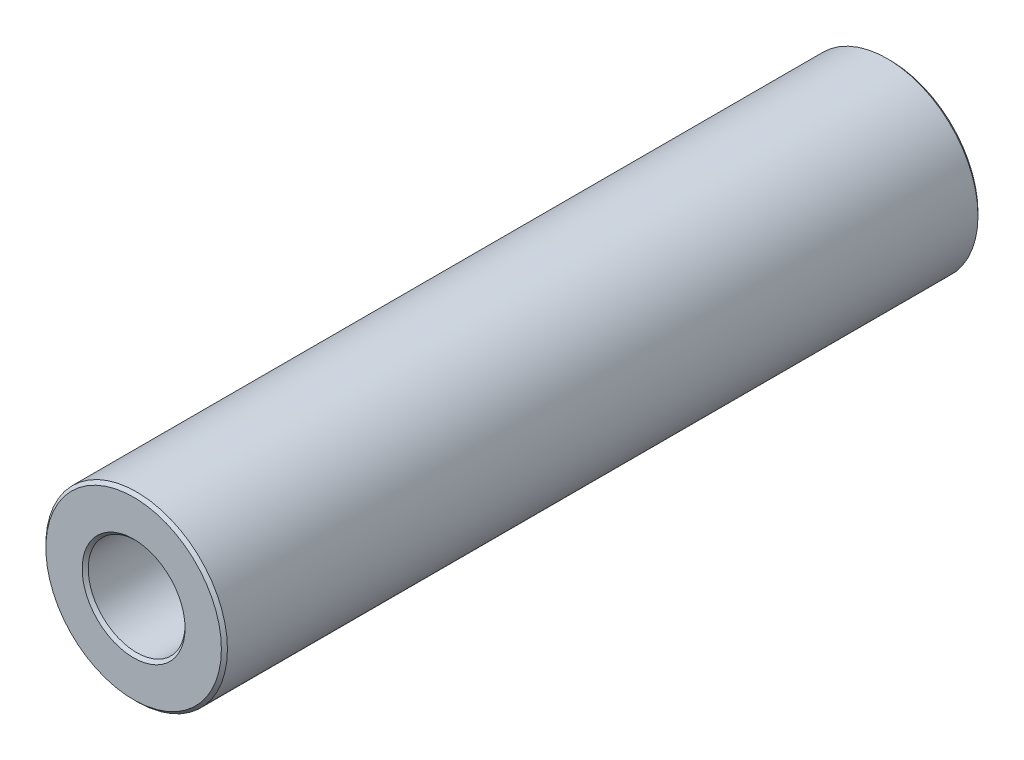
ISO-10303-21;
HEADER;
FILE_DESCRIPTION(('STEP AP214'),'2;1');
FILE_NAME('part.step','',(''),(''),'','','');
FILE_SCHEMA(('AUTOMOTIVE_DESIGN { 1 0 10303 214 1 1 1 1 }'));
ENDSEC;
DATA;
#1=APPLICATION_CONTEXT('core data for automotive mechanical design processes');
#2=APPLICATION_PROTOCOL_DEFINITION('international standard','automotive_design',2000,#1);
#3=PRODUCT_CONTEXT('',#1,'mechanical');
#4=PRODUCT('Part','Part','',(#3));
#5=PRODUCT_RELATED_PRODUCT_CATEGORY('part','',(#4));
#6=PRODUCT_DEFINITION_FORMATION('','',#4);
#7=PRODUCT_DEFINITION_CONTEXT('part definition',#1,'design');
#8=PRODUCT_DEFINITION('design','',#6,#7);
#9=PRODUCT_DEFINITION_SHAPE('','',#8);
#10=(LENGTH_UNIT() NAMED_UNIT(*) SI_UNIT(.MILLI.,.METRE.));
#11=(NAMED_UNIT(*) PLANE_ANGLE_UNIT() SI_UNIT($,.RADIAN.));
#12=(NAMED_UNIT(*) SI_UNIT($,.STERADIAN.) SOLID_ANGLE_UNIT());
#13=UNCERTAINTY_MEASURE_WITH_UNIT(LENGTH_MEASURE(1.E-05),#10,'distance_accuracy_value','');
#14=(GEOMETRIC_REPRESENTATION_CONTEXT(3) GLOBAL_UNCERTAINTY_ASSIGNED_CONTEXT((#13)) GLOBAL_UNIT_ASSIGNED_CONTEXT((#10,
#11,#12)) REPRESENTATION_CONTEXT('',''));
#15=CARTESIAN_POINT('',(0.,0.,0.));
#16=DIRECTION('',(0.,0.,1.));
#17=DIRECTION('',(1.,0.,0.));
#18=AXIS2_PLACEMENT_3D('',#15,#16,#17);
#19=CARTESIAN_POINT('',(0.,0.,12.5));
#20=DIRECTION('',(0.,0.,1.));
#21=DIRECTION('',(1.,0.,0.));
#22=AXIS2_PLACEMENT_3D('',#19,#20,#21);
#23=PLANE('',#22);
#24=CARTESIAN_POINT('',(0.,0.,12.5));
#25=DIRECTION('',(0.,0.,1.));
#26=DIRECTION('',(1.,0.,0.));
#27=AXIS2_PLACEMENT_3D('',#24,#25,#26);
#28=CIRCLE('',#27,1.7);
#29=CARTESIAN_POINT('',(1.7,0.,12.5));
#30=VERTEX_POINT('',#29);
#31=EDGE_CURVE('E10',#30,#30,#28,.F.);
#32=ORIENTED_EDGE('',*,*,#31,.T.);
#33=EDGE_LOOP('',(#32));
#34=FACE_BOUND('',#33,.T.);
#35=CARTESIAN_POINT('',(0.,0.,12.5));
#36=DIRECTION('',(0.,0.,1.));
#37=DIRECTION('',(1.,0.,0.));
#38=AXIS2_PLACEMENT_3D('',#35,#36,#37);
#39=CIRCLE('',#38,2.9);
#40=CARTESIAN_POINT('',(2.9,0.,12.5));
#41=VERTEX_POINT('',#40);
#42=EDGE_CURVE('E45',#41,#41,#39,.T.);
#43=ORIENTED_EDGE('',*,*,#42,.T.);
#44=EDGE_LOOP('',(#43));
#45=FACE_BOUND('',#44,.T.);
#46=ADVANCED_FACE('F37',(#34,#45),#23,.T.);
#47=CARTESIAN_POINT('',(0.,0.,-12.5));
#48=DIRECTION('',(0.,0.,1.));
#49=DIRECTION('',(1.,0.,0.));
#50=AXIS2_PLACEMENT_3D('',#47,#48,#49);
#51=PLANE('',#50);
#52=CARTESIAN_POINT('',(0.,0.,-12.5));
#53=DIRECTION('',(0.,0.,1.));
#54=DIRECTION('',(1.,0.,0.));
#55=AXIS2_PLACEMENT_3D('',#52,#53,#54);
#56=CIRCLE('',#55,2.9);
#57=CARTESIAN_POINT('',(2.9,0.,-12.5));
#58=VERTEX_POINT('',#57);
#59=EDGE_CURVE('E62',#58,#58,#56,.F.);
#60=ORIENTED_EDGE('',*,*,#59,.T.);
#61=EDGE_LOOP('',(#60));
#62=FACE_BOUND('',#61,.T.);
#63=CARTESIAN_POINT('',(0.,0.,-12.5));
#64=DIRECTION('',(0.,0.,1.));
#65=DIRECTION('',(1.,0.,0.));
#66=AXIS2_PLACEMENT_3D('',#63,#64,#65);
#67=CIRCLE('',#66,1.7);
#68=CARTESIAN_POINT('',(1.7,0.,-12.5));
#69=VERTEX_POINT('',#68);
#70=EDGE_CURVE('E66',#69,#69,#67,.T.);
#71=ORIENTED_EDGE('',*,*,#70,.T.);
#72=EDGE_LOOP('',(#71));
#73=FACE_BOUND('',#72,.T.);
#74=ADVANCED_FACE('F89',(#62,#73),#51,.F.);
#75=CARTESIAN_POINT('',(0.,0.,12.5));
#76=DIRECTION('',(0.,0.,-1.));
#77=DIRECTION('',(-1.,0.,0.));
#78=AXIS2_PLACEMENT_3D('',#75,#76,#77);
#79=CYLINDRICAL_SURFACE('',#78,3.);
#80=CARTESIAN_POINT('',(0.,0.,-12.4));
#81=DIRECTION('',(0.,0.,1.));
#82=DIRECTION('',(1.,0.,0.));
#83=AXIS2_PLACEMENT_3D('',#80,#81,#82);
#84=CIRCLE('',#83,3.);
#85=CARTESIAN_POINT('',(3.,0.,-12.4));
#86=VERTEX_POINT('',#85);
#87=EDGE_CURVE('E69',#86,#86,#84,.T.);
#88=ORIENTED_EDGE('',*,*,#87,.T.);
#89=EDGE_LOOP('',(#88));
#90=FACE_BOUND('',#89,.T.);
#91=CARTESIAN_POINT('',(0.,0.,12.4));
#92=DIRECTION('',(0.,0.,1.));
#93=DIRECTION('',(1.,0.,0.));
#94=AXIS2_PLACEMENT_3D('',#91,#92,#93);
#95=CIRCLE('',#94,3.);
#96=CARTESIAN_POINT('',(3.,0.,12.4));
#97=VERTEX_POINT('',#96);
#98=EDGE_CURVE('E73',#97,#97,#95,.F.);
#99=ORIENTED_EDGE('',*,*,#98,.T.);
#100=EDGE_LOOP('',(#99));
#101=FACE_BOUND('',#100,.T.);
#102=ADVANCED_FACE('F78',(#90,#101),#79,.T.);
#103=CARTESIAN_POINT('',(0.,0.,12.5));
#104=DIRECTION('',(0.,0.,-1.));
#105=DIRECTION('',(-1.,0.,0.));
#106=AXIS2_PLACEMENT_3D('',#103,#104,#105);
#107=CYLINDRICAL_SURFACE('',#106,1.6);
#108=CARTESIAN_POINT('',(0.,0.,-12.4));
#109=DIRECTION('',(0.,0.,1.));
#110=DIRECTION('',(1.,0.,0.));
#111=AXIS2_PLACEMENT_3D('',#108,#109,#110);
#112=CIRCLE('',#111,1.6);
#113=CARTESIAN_POINT('',(1.6,0.,-12.4));
#114=VERTEX_POINT('',#113);
#115=EDGE_CURVE('E51',#114,#114,#112,.F.);
#116=ORIENTED_EDGE('',*,*,#115,.T.);
#117=EDGE_LOOP('',(#116));
#118=FACE_BOUND('',#117,.T.);
#119=CARTESIAN_POINT('',(0.,0.,12.4));
#120=DIRECTION('',(0.,0.,1.));
#121=DIRECTION('',(1.,0.,0.));
#122=AXIS2_PLACEMENT_3D('',#119,#120,#121);
#123=CIRCLE('',#122,1.6);
#124=CARTESIAN_POINT('',(1.6,0.,12.4));
#125=VERTEX_POINT('',#124);
#126=EDGE_CURVE('E57',#125,#125,#123,.T.);
#127=ORIENTED_EDGE('',*,*,#126,.T.);
#128=EDGE_LOOP('',(#127));
#129=FACE_BOUND('',#128,.T.);
#130=ADVANCED_FACE('F97',(#118,#129),#107,.F.);
#131=CARTESIAN_POINT('',(0.,0.,-12.4));
#132=DIRECTION('',(0.,0.,1.));
#133=DIRECTION('',(1.,0.,0.));
#134=AXIS2_PLACEMENT_3D('',#131,#132,#133);
#135=CONICAL_SURFACE('',#134,3.,0.785398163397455);
#136=ORIENTED_EDGE('',*,*,#59,.F.);
#137=EDGE_LOOP('',(#136));
#138=FACE_BOUND('',#137,.T.);
#139=ORIENTED_EDGE('',*,*,#87,.F.);
#140=EDGE_LOOP('',(#139));
#141=FACE_BOUND('',#140,.T.);
#142=ADVANCED_FACE('F102',(#138,#141),#135,.T.);
#143=CARTESIAN_POINT('',(0.,0.,-12.5));
#144=DIRECTION('',(0.,0.,-1.));
#145=DIRECTION('',(-1.,0.,0.));
#146=AXIS2_PLACEMENT_3D('',#143,#144,#145);
#147=CONICAL_SURFACE('',#146,1.7,0.785398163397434);
#148=ORIENTED_EDGE('',*,*,#115,.F.);
#149=EDGE_LOOP('',(#148));
#150=FACE_BOUND('',#149,.T.);
#151=ORIENTED_EDGE('',*,*,#70,.F.);
#152=EDGE_LOOP('',(#151));
#153=FACE_BOUND('',#152,.T.);
#154=ADVANCED_FACE('F86',(#150,#153),#147,.F.);
#155=CARTESIAN_POINT('',(0.,0.,12.4));
#156=DIRECTION('',(0.,0.,1.));
#157=DIRECTION('',(1.,0.,0.));
#158=AXIS2_PLACEMENT_3D('',#155,#156,#157);
#159=CONICAL_SURFACE('',#158,1.6,0.785398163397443);
#160=ORIENTED_EDGE('',*,*,#31,.F.);
#161=EDGE_LOOP('',(#160));
#162=FACE_BOUND('',#161,.T.);
#163=ORIENTED_EDGE('',*,*,#126,.F.);
#164=EDGE_LOOP('',(#163));
#165=FACE_BOUND('',#164,.T.);
#166=ADVANCED_FACE('F82',(#162,#165),#159,.F.);
#167=CARTESIAN_POINT('',(0.,0.,12.5));
#168=DIRECTION('',(0.,0.,-1.));
#169=DIRECTION('',(-1.,0.,0.));
#170=AXIS2_PLACEMENT_3D('',#167,#168,#169);
#171=CONICAL_SURFACE('',#170,2.9,0.785398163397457);
#172=ORIENTED_EDGE('',*,*,#98,.F.);
#173=EDGE_LOOP('',(#172));
#174=FACE_BOUND('',#173,.T.);
#175=ORIENTED_EDGE('',*,*,#42,.F.);
#176=EDGE_LOOP('',(#175));
#177=FACE_BOUND('',#176,.T.);
#178=ADVANCED_FACE('F39',(#174,#177),#171,.T.);
#179=CLOSED_SHELL('',(#46,#74,#102,#130,#142,#154,#166,#178));
#180=MANIFOLD_SOLID_BREP('B2',#179);
#181=ADVANCED_BREP_SHAPE_REPRESENTATION('',(#18,#180),#14);
#182=SHAPE_DEFINITION_REPRESENTATION(#9,#181);
ENDSEC;
END-ISO-10303-21;
